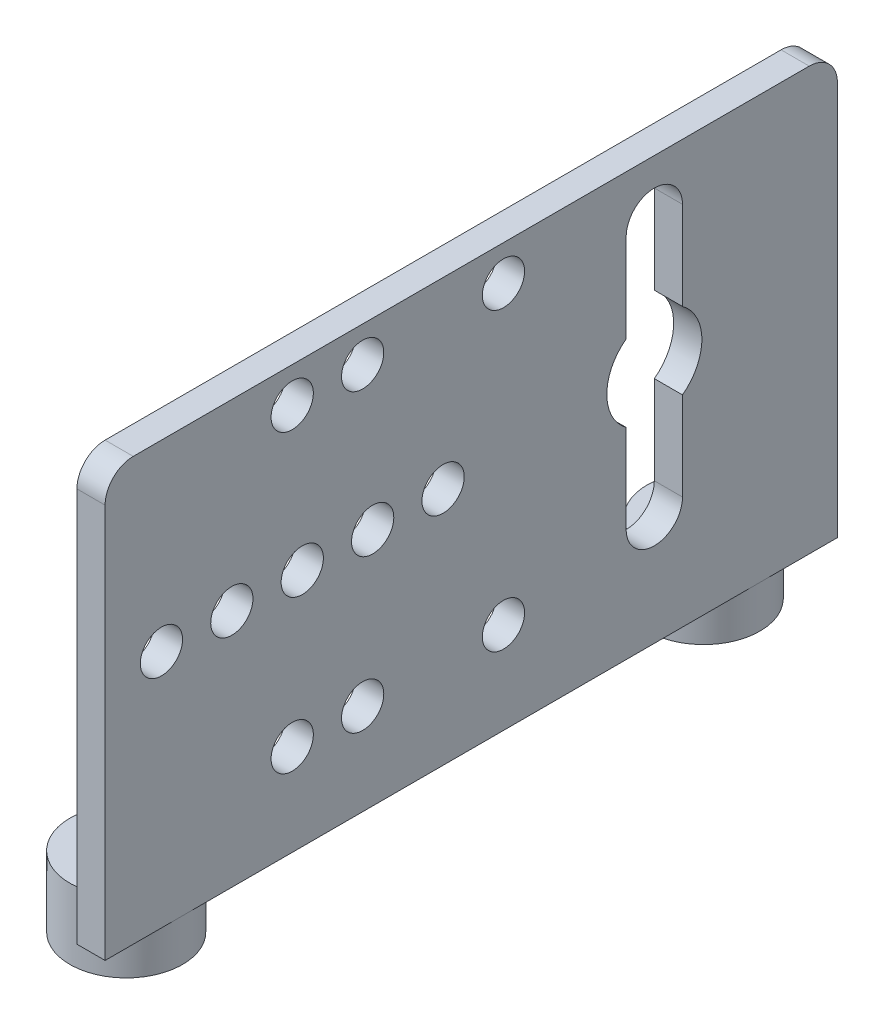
ISO-10303-21;
HEADER;
FILE_DESCRIPTION(('STEP AP214'),'2;1');
FILE_NAME('part.step','',(''),(''),'','','');
FILE_SCHEMA(('AUTOMOTIVE_DESIGN { 1 0 10303 214 1 1 1 1 }'));
ENDSEC;
DATA;
#1=APPLICATION_CONTEXT('core data for automotive mechanical design processes');
#2=APPLICATION_PROTOCOL_DEFINITION('international standard','automotive_design',2000,#1);
#3=PRODUCT_CONTEXT('',#1,'mechanical');
#4=PRODUCT('Part','Part','',(#3));
#5=PRODUCT_RELATED_PRODUCT_CATEGORY('part','',(#4));
#6=PRODUCT_DEFINITION_FORMATION('','',#4);
#7=PRODUCT_DEFINITION_CONTEXT('part definition',#1,'design');
#8=PRODUCT_DEFINITION('design','',#6,#7);
#9=PRODUCT_DEFINITION_SHAPE('','',#8);
#10=(LENGTH_UNIT() NAMED_UNIT(*) SI_UNIT(.MILLI.,.METRE.));
#11=(NAMED_UNIT(*) PLANE_ANGLE_UNIT() SI_UNIT($,.RADIAN.));
#12=(NAMED_UNIT(*) SI_UNIT($,.STERADIAN.) SOLID_ANGLE_UNIT());
#13=UNCERTAINTY_MEASURE_WITH_UNIT(LENGTH_MEASURE(1.E-05),#10,'distance_accuracy_value','');
#14=(GEOMETRIC_REPRESENTATION_CONTEXT(3) GLOBAL_UNCERTAINTY_ASSIGNED_CONTEXT((#13)) GLOBAL_UNIT_ASSIGNED_CONTEXT((#10,
#11,#12)) REPRESENTATION_CONTEXT('',''));
#15=CARTESIAN_POINT('',(0.,0.,0.));
#16=DIRECTION('',(0.,0.,1.));
#17=DIRECTION('',(1.,0.,0.));
#18=AXIS2_PLACEMENT_3D('',#15,#16,#17);
#19=CARTESIAN_POINT('',(0.,0.,52.));
#20=DIRECTION('',(0.,1.,0.));
#21=DIRECTION('',(0.,0.,1.));
#22=AXIS2_PLACEMENT_3D('',#19,#20,#21);
#23=PLANE('',#22);
#24=DIRECTION('',(0.,0.,-1.));
#25=VECTOR('',#24,1.);
#26=CARTESIAN_POINT('',(0.,0.,52.));
#27=LINE('',#26,#25);
#28=CARTESIAN_POINT('',(0.,0.,43.0358983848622));
#29=VERTEX_POINT('',#28);
#30=CARTESIAN_POINT('',(0.,0.,8.96410161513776));
#31=VERTEX_POINT('',#30);
#32=EDGE_CURVE('E385',#29,#31,#27,.T.);
#33=ORIENTED_EDGE('',*,*,#32,.T.);
#34=CARTESIAN_POINT('',(-2.,0.,5.5));
#35=DIRECTION('',(0.,1.,0.));
#36=DIRECTION('',(0.,0.,1.));
#37=AXIS2_PLACEMENT_3D('',#34,#35,#36);
#38=CIRCLE('',#37,4.);
#39=CARTESIAN_POINT('',(2.,0.,5.5));
#40=VERTEX_POINT('',#39);
#41=EDGE_CURVE('E256',#31,#40,#38,.T.);
#42=ORIENTED_EDGE('',*,*,#41,.T.);
#43=DIRECTION('',(0.,0.,1.));
#44=VECTOR('',#43,1.);
#45=CARTESIAN_POINT('',(2.,0.,0.));
#46=LINE('',#45,#44);
#47=CARTESIAN_POINT('',(2.,0.,46.5));
#48=VERTEX_POINT('',#47);
#49=EDGE_CURVE('E292',#40,#48,#46,.T.);
#50=ORIENTED_EDGE('',*,*,#49,.T.);
#51=CARTESIAN_POINT('',(-2.,0.,46.5));
#52=DIRECTION('',(0.,1.,0.));
#53=DIRECTION('',(0.,0.,1.));
#54=AXIS2_PLACEMENT_3D('',#51,#52,#53);
#55=CIRCLE('',#54,4.);
#56=EDGE_CURVE('E281',#29,#48,#55,.F.);
#57=ORIENTED_EDGE('',*,*,#56,.F.);
#58=EDGE_LOOP('',(#33,#42,#50,#57));
#59=FACE_BOUND('',#58,.T.);
#60=ADVANCED_FACE('F33',(#59),#23,.F.);
#61=CARTESIAN_POINT('',(0.,30.,52.));
#62=DIRECTION('',(1.,0.,0.));
#63=DIRECTION('',(0.,1.,0.));
#64=AXIS2_PLACEMENT_3D('',#61,#62,#63);
#65=PLANE('',#64);
#66=DIRECTION('',(0.,-1.,0.));
#67=VECTOR('',#66,1.);
#68=CARTESIAN_POINT('',(0.,30.,15.));
#69=LINE('',#68,#67);
#70=CARTESIAN_POINT('',(0.,14.2814296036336,15.));
#71=VERTEX_POINT('',#70);
#72=CARTESIAN_POINT('',(0.,8.00000000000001,15.));
#73=VERTEX_POINT('',#72);
#74=EDGE_CURVE('E201',#71,#73,#69,.T.);
#75=ORIENTED_EDGE('',*,*,#74,.T.);
#76=CARTESIAN_POINT('',(0.,8.,13.));
#77=DIRECTION('',(1.,0.,0.));
#78=DIRECTION('',(0.,1.,0.));
#79=AXIS2_PLACEMENT_3D('',#76,#77,#78);
#80=CIRCLE('',#79,2.);
#81=CARTESIAN_POINT('',(0.,8.,11.));
#82=VERTEX_POINT('',#81);
#83=EDGE_CURVE('E170',#73,#82,#80,.T.);
#84=ORIENTED_EDGE('',*,*,#83,.T.);
#85=DIRECTION('',(0.,1.,0.));
#86=VECTOR('',#85,1.);
#87=CARTESIAN_POINT('',(0.,30.,11.));
#88=LINE('',#87,#86);
#89=CARTESIAN_POINT('',(0.,14.2814296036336,11.));
#90=VERTEX_POINT('',#89);
#91=EDGE_CURVE('E234',#82,#90,#88,.T.);
#92=ORIENTED_EDGE('',*,*,#91,.T.);
#93=CARTESIAN_POINT('',(0.,17.,13.));
#94=DIRECTION('',(1.,0.,0.));
#95=DIRECTION('',(0.,1.,0.));
#96=AXIS2_PLACEMENT_3D('',#93,#94,#95);
#97=CIRCLE('',#96,3.375);
#98=CARTESIAN_POINT('',(0.,19.7185703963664,11.));
#99=VERTEX_POINT('',#98);
#100=EDGE_CURVE('E231',#90,#99,#97,.T.);
#101=ORIENTED_EDGE('',*,*,#100,.T.);
#102=DIRECTION('',(0.,1.,0.));
#103=VECTOR('',#102,1.);
#104=CARTESIAN_POINT('',(0.,30.,11.));
#105=LINE('',#104,#103);
#106=CARTESIAN_POINT('',(0.,26.,11.));
#107=VERTEX_POINT('',#106);
#108=EDGE_CURVE('E228',#99,#107,#105,.T.);
#109=ORIENTED_EDGE('',*,*,#108,.T.);
#110=CARTESIAN_POINT('',(0.,26.,13.));
#111=DIRECTION('',(1.,0.,0.));
#112=DIRECTION('',(0.,1.,0.));
#113=AXIS2_PLACEMENT_3D('',#110,#111,#112);
#114=CIRCLE('',#113,2.);
#115=CARTESIAN_POINT('',(0.,26.,15.));
#116=VERTEX_POINT('',#115);
#117=EDGE_CURVE('E225',#107,#116,#114,.T.);
#118=ORIENTED_EDGE('',*,*,#117,.T.);
#119=DIRECTION('',(0.,-1.,0.));
#120=VECTOR('',#119,1.);
#121=CARTESIAN_POINT('',(0.,30.,15.));
#122=LINE('',#121,#120);
#123=CARTESIAN_POINT('',(0.,19.7185703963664,15.));
#124=VERTEX_POINT('',#123);
#125=EDGE_CURVE('E222',#116,#124,#122,.T.);
#126=ORIENTED_EDGE('',*,*,#125,.T.);
#127=CARTESIAN_POINT('',(0.,17.,13.));
#128=DIRECTION('',(1.,0.,0.));
#129=DIRECTION('',(0.,1.,0.));
#130=AXIS2_PLACEMENT_3D('',#127,#128,#129);
#131=CIRCLE('',#130,3.375);
#132=EDGE_CURVE('E219',#124,#71,#131,.T.);
#133=ORIENTED_EDGE('',*,*,#132,.T.);
#134=EDGE_LOOP('',(#75,#84,#92,#101,#109,#118,#126,#133));
#135=FACE_BOUND('',#134,.T.);
#136=CARTESIAN_POINT('',(0.,0.,2.03589838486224));
#137=VERTEX_POINT('',#136);
#138=CARTESIAN_POINT('',(0.,0.,0.));
#139=VERTEX_POINT('',#138);
#140=EDGE_CURVE('E381',#137,#139,#27,.T.);
#141=ORIENTED_EDGE('',*,*,#140,.F.);
#142=DIRECTION('',(0.,1.,0.));
#143=VECTOR('',#142,1.);
#144=CARTESIAN_POINT('',(0.,-3.,2.03589838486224));
#145=LINE('',#144,#143);
#146=CARTESIAN_POINT('',(0.,2.,2.03589838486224));
#147=VERTEX_POINT('',#146);
#148=EDGE_CURVE('E255',#137,#147,#145,.T.);
#149=ORIENTED_EDGE('',*,*,#148,.T.);
#150=DIRECTION('',(0.,0.,-1.));
#151=VECTOR('',#150,1.);
#152=CARTESIAN_POINT('',(0.,2.,52.));
#153=LINE('',#152,#151);
#154=CARTESIAN_POINT('',(0.,2.,8.96410161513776));
#155=VERTEX_POINT('',#154);
#156=EDGE_CURVE('E248',#155,#147,#153,.T.);
#157=ORIENTED_EDGE('',*,*,#156,.F.);
#158=DIRECTION('',(0.,1.,0.));
#159=VECTOR('',#158,1.);
#160=CARTESIAN_POINT('',(0.,-3.,8.96410161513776));
#161=LINE('',#160,#159);
#162=EDGE_CURVE('E259',#155,#31,#161,.F.);
#163=ORIENTED_EDGE('',*,*,#162,.T.);
#164=ORIENTED_EDGE('',*,*,#32,.F.);
#165=DIRECTION('',(0.,1.,0.));
#166=VECTOR('',#165,1.);
#167=CARTESIAN_POINT('',(0.,-3.,43.0358983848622));
#168=LINE('',#167,#166);
#169=CARTESIAN_POINT('',(0.,2.,43.0358983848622));
#170=VERTEX_POINT('',#169);
#171=EDGE_CURVE('E284',#170,#29,#168,.F.);
#172=ORIENTED_EDGE('',*,*,#171,.F.);
#173=DIRECTION('',(0.,0.,-1.));
#174=VECTOR('',#173,1.);
#175=CARTESIAN_POINT('',(0.,2.,52.));
#176=LINE('',#175,#174);
#177=CARTESIAN_POINT('',(0.,2.,49.9641016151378));
#178=VERTEX_POINT('',#177);
#179=EDGE_CURVE('E272',#178,#170,#176,.T.);
#180=ORIENTED_EDGE('',*,*,#179,.F.);
#181=DIRECTION('',(0.,1.,0.));
#182=VECTOR('',#181,1.);
#183=CARTESIAN_POINT('',(0.,-3.,49.9641016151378));
#184=LINE('',#183,#182);
#185=CARTESIAN_POINT('',(0.,0.,49.9641016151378));
#186=VERTEX_POINT('',#185);
#187=EDGE_CURVE('E280',#186,#178,#184,.T.);
#188=ORIENTED_EDGE('',*,*,#187,.F.);
#189=CARTESIAN_POINT('',(0.,0.,52.));
#190=VERTEX_POINT('',#189);
#191=EDGE_CURVE('E382',#190,#186,#27,.T.);
#192=ORIENTED_EDGE('',*,*,#191,.F.);
#193=DIRECTION('',(0.,-1.,0.));
#194=VECTOR('',#193,1.);
#195=CARTESIAN_POINT('',(0.,30.,52.));
#196=LINE('',#195,#194);
#197=CARTESIAN_POINT('',(0.,28.,52.));
#198=VERTEX_POINT('',#197);
#199=EDGE_CURVE('E359',#198,#190,#196,.T.);
#200=ORIENTED_EDGE('',*,*,#199,.F.);
#201=CARTESIAN_POINT('',(0.,28.,50.));
#202=DIRECTION('',(1.,0.,0.));
#203=DIRECTION('',(0.,1.,0.));
#204=AXIS2_PLACEMENT_3D('',#201,#202,#203);
#205=CIRCLE('',#204,2.);
#206=CARTESIAN_POINT('',(0.,30.,50.));
#207=VERTEX_POINT('',#206);
#208=EDGE_CURVE('E390',#198,#207,#205,.F.);
#209=ORIENTED_EDGE('',*,*,#208,.T.);
#210=DIRECTION('',(0.,0.,-1.));
#211=VECTOR('',#210,1.);
#212=CARTESIAN_POINT('',(0.,30.,52.));
#213=LINE('',#212,#211);
#214=CARTESIAN_POINT('',(0.,30.,2.00000000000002));
#215=VERTEX_POINT('',#214);
#216=EDGE_CURVE('E368',#207,#215,#213,.T.);
#217=ORIENTED_EDGE('',*,*,#216,.T.);
#218=CARTESIAN_POINT('',(0.,28.,2.));
#219=DIRECTION('',(1.,0.,0.));
#220=DIRECTION('',(0.,1.,0.));
#221=AXIS2_PLACEMENT_3D('',#218,#219,#220);
#222=CIRCLE('',#221,2.);
#223=CARTESIAN_POINT('',(0.,28.,0.));
#224=VERTEX_POINT('',#223);
#225=EDGE_CURVE('E392',#215,#224,#222,.F.);
#226=ORIENTED_EDGE('',*,*,#225,.T.);
#227=DIRECTION('',(0.,-1.,0.));
#228=VECTOR('',#227,1.);
#229=CARTESIAN_POINT('',(0.,30.,0.));
#230=LINE('',#229,#228);
#231=EDGE_CURVE('E358',#224,#139,#230,.T.);
#232=ORIENTED_EDGE('',*,*,#231,.T.);
#233=EDGE_LOOP('',(#141,#149,#157,#163,#164,#172,#180,#188,#192,#200,#209,#217,#226,#232));
#234=FACE_BOUND('',#233,.T.);
#235=CARTESIAN_POINT('',(0.,17.,43.));
#236=DIRECTION('',(1.,0.,0.));
#237=DIRECTION('',(0.,1.,0.));
#238=AXIS2_PLACEMENT_3D('',#235,#236,#237);
#239=CIRCLE('',#238,1.5);
#240=CARTESIAN_POINT('',(0.,18.5,43.));
#241=VERTEX_POINT('',#240);
#242=EDGE_CURVE('E355',#241,#241,#239,.F.);
#243=ORIENTED_EDGE('',*,*,#242,.F.);
#244=EDGE_LOOP('',(#243));
#245=FACE_BOUND('',#244,.T.);
#246=CARTESIAN_POINT('',(0.,17.,38.));
#247=DIRECTION('',(1.,0.,0.));
#248=DIRECTION('',(0.,1.,0.));
#249=AXIS2_PLACEMENT_3D('',#246,#247,#248);
#250=CIRCLE('',#249,1.5);
#251=CARTESIAN_POINT('',(0.,18.5,38.));
#252=VERTEX_POINT('',#251);
#253=EDGE_CURVE('E337',#252,#252,#250,.F.);
#254=ORIENTED_EDGE('',*,*,#253,.F.);
#255=EDGE_LOOP('',(#254));
#256=FACE_BOUND('',#255,.T.);
#257=CARTESIAN_POINT('',(0.,17.,28.));
#258=DIRECTION('',(1.,0.,0.));
#259=DIRECTION('',(0.,1.,0.));
#260=AXIS2_PLACEMENT_3D('',#257,#258,#259);
#261=CIRCLE('',#260,1.5);
#262=CARTESIAN_POINT('',(0.,18.5,28.));
#263=VERTEX_POINT('',#262);
#264=EDGE_CURVE('E326',#263,#263,#261,.F.);
#265=ORIENTED_EDGE('',*,*,#264,.F.);
#266=EDGE_LOOP('',(#265));
#267=FACE_BOUND('',#266,.T.);
#268=CARTESIAN_POINT('',(0.,27.5,38.7121426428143));
#269=DIRECTION('',(1.,0.,0.));
#270=DIRECTION('',(0.,1.,0.));
#271=AXIS2_PLACEMENT_3D('',#268,#269,#270);
#272=CIRCLE('',#271,1.5);
#273=CARTESIAN_POINT('',(0.,29.,38.7121426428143));
#274=VERTEX_POINT('',#273);
#275=EDGE_CURVE('E327',#274,#274,#272,.F.);
#276=ORIENTED_EDGE('',*,*,#275,.F.);
#277=EDGE_LOOP('',(#276));
#278=FACE_BOUND('',#277,.T.);
#279=CARTESIAN_POINT('',(0.,17.,48.));
#280=DIRECTION('',(1.,0.,0.));
#281=DIRECTION('',(0.,1.,0.));
#282=AXIS2_PLACEMENT_3D('',#279,#280,#281);
#283=CIRCLE('',#282,1.5);
#284=CARTESIAN_POINT('',(0.,18.5,48.));
#285=VERTEX_POINT('',#284);
#286=EDGE_CURVE('E345',#285,#285,#283,.F.);
#287=ORIENTED_EDGE('',*,*,#286,.F.);
#288=EDGE_LOOP('',(#287));
#289=FACE_BOUND('',#288,.T.);
#290=CARTESIAN_POINT('',(0.,17.,33.));
#291=DIRECTION('',(1.,0.,0.));
#292=DIRECTION('',(0.,1.,0.));
#293=AXIS2_PLACEMENT_3D('',#290,#291,#292);
#294=CIRCLE('',#293,1.5);
#295=CARTESIAN_POINT('',(0.,18.5,33.));
#296=VERTEX_POINT('',#295);
#297=EDGE_CURVE('E344',#296,#296,#294,.F.);
#298=ORIENTED_EDGE('',*,*,#297,.F.);
#299=EDGE_LOOP('',(#298));
#300=FACE_BOUND('',#299,.T.);
#301=CARTESIAN_POINT('',(0.,6.50000000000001,23.7121426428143));
#302=DIRECTION('',(1.,0.,0.));
#303=DIRECTION('',(0.,1.,0.));
#304=AXIS2_PLACEMENT_3D('',#301,#302,#303);
#305=CIRCLE('',#304,1.5);
#306=CARTESIAN_POINT('',(0.,8.00000000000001,23.7121426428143));
#307=VERTEX_POINT('',#306);
#308=EDGE_CURVE('E304',#307,#307,#305,.F.);
#309=ORIENTED_EDGE('',*,*,#308,.F.);
#310=EDGE_LOOP('',(#309));
#311=FACE_BOUND('',#310,.T.);
#312=CARTESIAN_POINT('',(0.,27.5,23.7121426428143));
#313=DIRECTION('',(1.,0.,0.));
#314=DIRECTION('',(0.,1.,0.));
#315=AXIS2_PLACEMENT_3D('',#312,#313,#314);
#316=CIRCLE('',#315,1.5);
#317=CARTESIAN_POINT('',(0.,29.,23.7121426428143));
#318=VERTEX_POINT('',#317);
#319=EDGE_CURVE('E297',#318,#318,#316,.F.);
#320=ORIENTED_EDGE('',*,*,#319,.F.);
#321=EDGE_LOOP('',(#320));
#322=FACE_BOUND('',#321,.T.);
#323=CARTESIAN_POINT('',(0.,6.50000000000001,38.7121426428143));
#324=DIRECTION('',(1.,0.,0.));
#325=DIRECTION('',(0.,1.,0.));
#326=AXIS2_PLACEMENT_3D('',#323,#324,#325);
#327=CIRCLE('',#326,1.5);
#328=CARTESIAN_POINT('',(0.,8.00000000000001,38.7121426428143));
#329=VERTEX_POINT('',#328);
#330=EDGE_CURVE('E296',#329,#329,#327,.F.);
#331=ORIENTED_EDGE('',*,*,#330,.F.);
#332=EDGE_LOOP('',(#331));
#333=FACE_BOUND('',#332,.T.);
#334=CARTESIAN_POINT('',(0.,6.50000000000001,33.7121426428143));
#335=DIRECTION('',(1.,0.,0.));
#336=DIRECTION('',(0.,1.,0.));
#337=AXIS2_PLACEMENT_3D('',#334,#335,#336);
#338=CIRCLE('',#337,1.5);
#339=CARTESIAN_POINT('',(0.,8.00000000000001,33.7121426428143));
#340=VERTEX_POINT('',#339);
#341=EDGE_CURVE('E315',#340,#340,#338,.F.);
#342=ORIENTED_EDGE('',*,*,#341,.F.);
#343=EDGE_LOOP('',(#342));
#344=FACE_BOUND('',#343,.T.);
#345=CARTESIAN_POINT('',(0.,27.5,33.7121426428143));
#346=DIRECTION('',(1.,0.,0.));
#347=DIRECTION('',(0.,1.,0.));
#348=AXIS2_PLACEMENT_3D('',#345,#346,#347);
#349=CIRCLE('',#348,1.5);
#350=CARTESIAN_POINT('',(0.,29.,33.7121426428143));
#351=VERTEX_POINT('',#350);
#352=EDGE_CURVE('E314',#351,#351,#349,.F.);
#353=ORIENTED_EDGE('',*,*,#352,.F.);
#354=EDGE_LOOP('',(#353));
#355=FACE_BOUND('',#354,.T.);
#356=ADVANCED_FACE('F414',(#135,#234,#245,#256,#267,#278,#289,#300,#311,#322,#333,#344,#355),
#65,.F.);
#357=CARTESIAN_POINT('',(2.,0.,0.));
#358=VERTEX_POINT('',#357);
#359=EDGE_CURVE('E288',#358,#40,#46,.T.);
#360=ORIENTED_EDGE('',*,*,#359,.T.);
#361=EDGE_CURVE('E252',#40,#137,#38,.T.);
#362=ORIENTED_EDGE('',*,*,#361,.T.);
#363=ORIENTED_EDGE('',*,*,#140,.T.);
#364=DIRECTION('',(1.,0.,0.));
#365=VECTOR('',#364,1.);
#366=CARTESIAN_POINT('',(0.,0.,0.));
#367=LINE('',#366,#365);
#368=EDGE_CURVE('E371',#139,#358,#367,.T.);
#369=ORIENTED_EDGE('',*,*,#368,.T.);
#370=EDGE_LOOP('',(#360,#362,#363,#369));
#371=FACE_BOUND('',#370,.T.);
#372=ADVANCED_FACE('F420',(#371),#23,.F.);
#373=EDGE_CURVE('E277',#48,#186,#55,.F.);
#374=ORIENTED_EDGE('',*,*,#373,.F.);
#375=CARTESIAN_POINT('',(2.,0.,52.));
#376=VERTEX_POINT('',#375);
#377=EDGE_CURVE('E287',#48,#376,#46,.T.);
#378=ORIENTED_EDGE('',*,*,#377,.T.);
#379=DIRECTION('',(1.,0.,0.));
#380=VECTOR('',#379,1.);
#381=CARTESIAN_POINT('',(0.,0.,52.));
#382=LINE('',#381,#380);
#383=EDGE_CURVE('E361',#190,#376,#382,.T.);
#384=ORIENTED_EDGE('',*,*,#383,.F.);
#385=ORIENTED_EDGE('',*,*,#191,.T.);
#386=EDGE_LOOP('',(#374,#378,#384,#385));
#387=FACE_BOUND('',#386,.T.);
#388=ADVANCED_FACE('F438',(#387),#23,.F.);
#389=CARTESIAN_POINT('',(2.,3.,52.));
#390=DIRECTION('',(-1.,0.,0.));
#391=DIRECTION('',(0.,-1.,0.));
#392=AXIS2_PLACEMENT_3D('',#389,#390,#391);
#393=PLANE('',#392);
#394=DIRECTION('',(0.,-1.,0.));
#395=VECTOR('',#394,1.);
#396=CARTESIAN_POINT('',(2.00000000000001,8.,11.));
#397=LINE('',#396,#395);
#398=CARTESIAN_POINT('',(2.00000000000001,14.2814296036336,11.));
#399=VERTEX_POINT('',#398);
#400=CARTESIAN_POINT('',(2.00000000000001,8.,11.));
#401=VERTEX_POINT('',#400);
#402=EDGE_CURVE('E173',#399,#401,#397,.T.);
#403=ORIENTED_EDGE('',*,*,#402,.T.);
#404=CARTESIAN_POINT('',(2.00000000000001,8.,13.));
#405=DIRECTION('',(-1.,0.,0.));
#406=DIRECTION('',(0.,1.,0.));
#407=AXIS2_PLACEMENT_3D('',#404,#405,#406);
#408=CIRCLE('',#407,2.);
#409=CARTESIAN_POINT('',(2.00000000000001,8.,15.));
#410=VERTEX_POINT('',#409);
#411=EDGE_CURVE('E167',#401,#410,#408,.T.);
#412=ORIENTED_EDGE('',*,*,#411,.T.);
#413=DIRECTION('',(0.,1.,0.));
#414=VECTOR('',#413,1.);
#415=CARTESIAN_POINT('',(2.00000000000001,8.,15.));
#416=LINE('',#415,#414);
#417=CARTESIAN_POINT('',(2.,14.2814296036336,15.));
#418=VERTEX_POINT('',#417);
#419=EDGE_CURVE('E176',#410,#418,#416,.T.);
#420=ORIENTED_EDGE('',*,*,#419,.T.);
#421=CARTESIAN_POINT('',(2.00000000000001,17.,13.));
#422=DIRECTION('',(-1.,0.,0.));
#423=DIRECTION('',(0.,-1.,0.));
#424=AXIS2_PLACEMENT_3D('',#421,#422,#423);
#425=CIRCLE('',#424,3.375);
#426=CARTESIAN_POINT('',(2.00000000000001,19.7185703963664,15.));
#427=VERTEX_POINT('',#426);
#428=EDGE_CURVE('E56',#418,#427,#425,.T.);
#429=ORIENTED_EDGE('',*,*,#428,.T.);
#430=DIRECTION('',(0.,1.,0.));
#431=VECTOR('',#430,1.);
#432=CARTESIAN_POINT('',(2.00000000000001,26.,15.));
#433=LINE('',#432,#431);
#434=CARTESIAN_POINT('',(2.00000000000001,26.,15.));
#435=VERTEX_POINT('',#434);
#436=EDGE_CURVE('E187',#427,#435,#433,.T.);
#437=ORIENTED_EDGE('',*,*,#436,.T.);
#438=CARTESIAN_POINT('',(2.00000000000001,26.,13.));
#439=DIRECTION('',(-1.,0.,0.));
#440=DIRECTION('',(0.,-1.,0.));
#441=AXIS2_PLACEMENT_3D('',#438,#439,#440);
#442=CIRCLE('',#441,2.);
#443=CARTESIAN_POINT('',(2.00000000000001,26.,11.));
#444=VERTEX_POINT('',#443);
#445=EDGE_CURVE('E190',#435,#444,#442,.T.);
#446=ORIENTED_EDGE('',*,*,#445,.T.);
#447=DIRECTION('',(0.,-1.,0.));
#448=VECTOR('',#447,1.);
#449=CARTESIAN_POINT('',(2.00000000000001,26.,11.));
#450=LINE('',#449,#448);
#451=CARTESIAN_POINT('',(2.00000000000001,19.7185703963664,11.));
#452=VERTEX_POINT('',#451);
#453=EDGE_CURVE('E193',#444,#452,#450,.T.);
#454=ORIENTED_EDGE('',*,*,#453,.T.);
#455=CARTESIAN_POINT('',(2.00000000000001,17.,13.));
#456=DIRECTION('',(-1.,0.,0.));
#457=DIRECTION('',(0.,-1.,0.));
#458=AXIS2_PLACEMENT_3D('',#455,#456,#457);
#459=CIRCLE('',#458,3.375);
#460=EDGE_CURVE('E196',#452,#399,#459,.T.);
#461=ORIENTED_EDGE('',*,*,#460,.T.);
#462=EDGE_LOOP('',(#403,#412,#420,#429,#437,#446,#454,#461));
#463=FACE_BOUND('',#462,.T.);
#464=ORIENTED_EDGE('',*,*,#377,.F.);
#465=ORIENTED_EDGE('',*,*,#49,.F.);
#466=ORIENTED_EDGE('',*,*,#359,.F.);
#467=DIRECTION('',(0.,1.,0.));
#468=VECTOR('',#467,1.);
#469=CARTESIAN_POINT('',(2.,3.,0.));
#470=LINE('',#469,#468);
#471=CARTESIAN_POINT('',(2.,28.,0.));
#472=VERTEX_POINT('',#471);
#473=EDGE_CURVE('E362',#358,#472,#470,.T.);
#474=ORIENTED_EDGE('',*,*,#473,.T.);
#475=CARTESIAN_POINT('',(2.,28.,2.));
#476=DIRECTION('',(-1.,0.,0.));
#477=DIRECTION('',(0.,-1.,0.));
#478=AXIS2_PLACEMENT_3D('',#475,#476,#477);
#479=CIRCLE('',#478,2.);
#480=CARTESIAN_POINT('',(2.,30.,2.00000000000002));
#481=VERTEX_POINT('',#480);
#482=EDGE_CURVE('E41',#472,#481,#479,.F.);
#483=ORIENTED_EDGE('',*,*,#482,.T.);
#484=DIRECTION('',(0.,0.,-1.));
#485=VECTOR('',#484,1.);
#486=CARTESIAN_POINT('',(2.,30.,52.));
#487=LINE('',#486,#485);
#488=CARTESIAN_POINT('',(2.,30.,50.));
#489=VERTEX_POINT('',#488);
#490=EDGE_CURVE('E378',#489,#481,#487,.T.);
#491=ORIENTED_EDGE('',*,*,#490,.F.);
#492=CARTESIAN_POINT('',(2.,28.,50.));
#493=DIRECTION('',(-1.,0.,0.));
#494=DIRECTION('',(0.,-1.,0.));
#495=AXIS2_PLACEMENT_3D('',#492,#493,#494);
#496=CIRCLE('',#495,2.);
#497=CARTESIAN_POINT('',(2.,28.,52.));
#498=VERTEX_POINT('',#497);
#499=EDGE_CURVE('E396',#489,#498,#496,.F.);
#500=ORIENTED_EDGE('',*,*,#499,.T.);
#501=DIRECTION('',(0.,1.,0.));
#502=VECTOR('',#501,1.);
#503=CARTESIAN_POINT('',(2.,3.,52.));
#504=LINE('',#503,#502);
#505=EDGE_CURVE('E365',#376,#498,#504,.T.);
#506=ORIENTED_EDGE('',*,*,#505,.F.);
#507=EDGE_LOOP('',(#464,#465,#466,#474,#483,#491,#500,#506));
#508=FACE_BOUND('',#507,.T.);
#509=CARTESIAN_POINT('',(2.,27.5,33.7121426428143));
#510=DIRECTION('',(1.,0.,0.));
#511=DIRECTION('',(0.,1.,0.));
#512=AXIS2_PLACEMENT_3D('',#509,#510,#511);
#513=CIRCLE('',#512,1.5);
#514=CARTESIAN_POINT('',(2.,29.,33.7121426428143));
#515=VERTEX_POINT('',#514);
#516=EDGE_CURVE('E311',#515,#515,#513,.T.);
#517=ORIENTED_EDGE('',*,*,#516,.F.);
#518=EDGE_LOOP('',(#517));
#519=FACE_BOUND('',#518,.T.);
#520=CARTESIAN_POINT('',(2.,6.50000000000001,33.7121426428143));
#521=DIRECTION('',(1.,0.,0.));
#522=DIRECTION('',(0.,-1.,0.));
#523=AXIS2_PLACEMENT_3D('',#520,#521,#522);
#524=CIRCLE('',#523,1.5);
#525=CARTESIAN_POINT('',(2.,5.00000000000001,33.7121426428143));
#526=VERTEX_POINT('',#525);
#527=EDGE_CURVE('E300',#526,#526,#524,.T.);
#528=ORIENTED_EDGE('',*,*,#527,.F.);
#529=EDGE_LOOP('',(#528));
#530=FACE_BOUND('',#529,.T.);
#531=CARTESIAN_POINT('',(2.,6.50000000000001,38.7121426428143));
#532=DIRECTION('',(1.,0.,0.));
#533=DIRECTION('',(0.,-1.,0.));
#534=AXIS2_PLACEMENT_3D('',#531,#532,#533);
#535=CIRCLE('',#534,1.5);
#536=CARTESIAN_POINT('',(2.,5.,38.7121426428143));
#537=VERTEX_POINT('',#536);
#538=EDGE_CURVE('E293',#537,#537,#535,.T.);
#539=ORIENTED_EDGE('',*,*,#538,.F.);
#540=EDGE_LOOP('',(#539));
#541=FACE_BOUND('',#540,.T.);
#542=CARTESIAN_POINT('',(2.,27.5,23.7121426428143));
#543=DIRECTION('',(1.,0.,0.));
#544=DIRECTION('',(0.,-1.,0.));
#545=AXIS2_PLACEMENT_3D('',#542,#543,#544);
#546=CIRCLE('',#545,1.5);
#547=CARTESIAN_POINT('',(2.,26.,23.7121426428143));
#548=VERTEX_POINT('',#547);
#549=EDGE_CURVE('E301',#548,#548,#546,.T.);
#550=ORIENTED_EDGE('',*,*,#549,.F.);
#551=EDGE_LOOP('',(#550));
#552=FACE_BOUND('',#551,.T.);
#553=CARTESIAN_POINT('',(2.,6.50000000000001,23.7121426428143));
#554=DIRECTION('',(1.,0.,0.));
#555=DIRECTION('',(0.,1.,0.));
#556=AXIS2_PLACEMENT_3D('',#553,#554,#555);
#557=CIRCLE('',#556,1.5);
#558=CARTESIAN_POINT('',(2.,8.00000000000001,23.7121426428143));
#559=VERTEX_POINT('',#558);
#560=EDGE_CURVE('E291',#559,#559,#557,.T.);
#561=ORIENTED_EDGE('',*,*,#560,.F.);
#562=EDGE_LOOP('',(#561));
#563=FACE_BOUND('',#562,.T.);
#564=CARTESIAN_POINT('',(2.,17.,33.));
#565=DIRECTION('',(1.,0.,0.));
#566=DIRECTION('',(0.,1.,0.));
#567=AXIS2_PLACEMENT_3D('',#564,#565,#566);
#568=CIRCLE('',#567,1.5);
#569=CARTESIAN_POINT('',(2.,18.5,33.));
#570=VERTEX_POINT('',#569);
#571=EDGE_CURVE('E341',#570,#570,#568,.T.);
#572=ORIENTED_EDGE('',*,*,#571,.F.);
#573=EDGE_LOOP('',(#572));
#574=FACE_BOUND('',#573,.T.);
#575=CARTESIAN_POINT('',(2.,17.,48.));
#576=DIRECTION('',(1.,0.,0.));
#577=DIRECTION('',(0.,1.,0.));
#578=AXIS2_PLACEMENT_3D('',#575,#576,#577);
#579=CIRCLE('',#578,1.5);
#580=CARTESIAN_POINT('',(2.,18.5,48.));
#581=VERTEX_POINT('',#580);
#582=EDGE_CURVE('E340',#581,#581,#579,.T.);
#583=ORIENTED_EDGE('',*,*,#582,.F.);
#584=EDGE_LOOP('',(#583));
#585=FACE_BOUND('',#584,.T.);
#586=CARTESIAN_POINT('',(2.,27.5,38.7121426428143));
#587=DIRECTION('',(1.,0.,0.));
#588=DIRECTION('',(0.,1.,0.));
#589=AXIS2_PLACEMENT_3D('',#586,#587,#588);
#590=CIRCLE('',#589,1.5);
#591=CARTESIAN_POINT('',(2.,29.,38.7121426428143));
#592=VERTEX_POINT('',#591);
#593=EDGE_CURVE('E318',#592,#592,#590,.T.);
#594=ORIENTED_EDGE('',*,*,#593,.F.);
#595=EDGE_LOOP('',(#594));
#596=FACE_BOUND('',#595,.T.);
#597=CARTESIAN_POINT('',(2.,17.,28.));
#598=DIRECTION('',(1.,0.,0.));
#599=DIRECTION('',(0.,1.,0.));
#600=AXIS2_PLACEMENT_3D('',#597,#598,#599);
#601=CIRCLE('',#600,1.5);
#602=CARTESIAN_POINT('',(2.,18.5,28.));
#603=VERTEX_POINT('',#602);
#604=EDGE_CURVE('E323',#603,#603,#601,.T.);
#605=ORIENTED_EDGE('',*,*,#604,.F.);
#606=EDGE_LOOP('',(#605));
#607=FACE_BOUND('',#606,.T.);
#608=CARTESIAN_POINT('',(2.,17.,38.));
#609=DIRECTION('',(1.,0.,0.));
#610=DIRECTION('',(0.,1.,0.));
#611=AXIS2_PLACEMENT_3D('',#608,#609,#610);
#612=CIRCLE('',#611,1.5);
#613=CARTESIAN_POINT('',(2.,18.5,38.));
#614=VERTEX_POINT('',#613);
#615=EDGE_CURVE('E330',#614,#614,#612,.T.);
#616=ORIENTED_EDGE('',*,*,#615,.F.);
#617=EDGE_LOOP('',(#616));
#618=FACE_BOUND('',#617,.T.);
#619=CARTESIAN_POINT('',(2.,17.,43.));
#620=DIRECTION('',(1.,0.,0.));
#621=DIRECTION('',(0.,1.,0.));
#622=AXIS2_PLACEMENT_3D('',#619,#620,#621);
#623=CIRCLE('',#622,1.5);
#624=CARTESIAN_POINT('',(2.,18.5,43.));
#625=VERTEX_POINT('',#624);
#626=EDGE_CURVE('E348',#625,#625,#623,.T.);
#627=ORIENTED_EDGE('',*,*,#626,.F.);
#628=EDGE_LOOP('',(#627));
#629=FACE_BOUND('',#628,.T.);
#630=ADVANCED_FACE('F180',(#463,#508,#519,#530,#541,#552,#563,#574,#585,#596,#607,#618,#629),
#393,.F.);
#631=CARTESIAN_POINT('',(2.,30.,52.));
#632=DIRECTION('',(0.,-1.,0.));
#633=DIRECTION('',(0.,0.,-1.));
#634=AXIS2_PLACEMENT_3D('',#631,#632,#633);
#635=PLANE('',#634);
#636=ORIENTED_EDGE('',*,*,#490,.T.);
#637=DIRECTION('',(-1.,0.,0.));
#638=VECTOR('',#637,1.);
#639=CARTESIAN_POINT('',(2.,30.,2.));
#640=LINE('',#639,#638);
#641=EDGE_CURVE('E387',#481,#215,#640,.T.);
#642=ORIENTED_EDGE('',*,*,#641,.T.);
#643=ORIENTED_EDGE('',*,*,#216,.F.);
#644=DIRECTION('',(-1.,0.,0.));
#645=VECTOR('',#644,1.);
#646=CARTESIAN_POINT('',(2.,30.,50.));
#647=LINE('',#646,#645);
#648=EDGE_CURVE('E384',#207,#489,#647,.F.);
#649=ORIENTED_EDGE('',*,*,#648,.T.);
#650=EDGE_LOOP('',(#636,#642,#643,#649));
#651=FACE_BOUND('',#650,.T.);
#652=ADVANCED_FACE('F407',(#651),#635,.F.);
#653=CARTESIAN_POINT('',(0.,0.,52.));
#654=DIRECTION('',(0.,0.,1.));
#655=DIRECTION('',(1.,0.,0.));
#656=AXIS2_PLACEMENT_3D('',#653,#654,#655);
#657=PLANE('',#656);
#658=ORIENTED_EDGE('',*,*,#383,.T.);
#659=ORIENTED_EDGE('',*,*,#505,.T.);
#660=DIRECTION('',(-1.,0.,0.));
#661=VECTOR('',#660,1.);
#662=CARTESIAN_POINT('',(0.,28.,52.));
#663=LINE('',#662,#661);
#664=EDGE_CURVE('E11',#498,#198,#663,.T.);
#665=ORIENTED_EDGE('',*,*,#664,.T.);
#666=ORIENTED_EDGE('',*,*,#199,.T.);
#667=EDGE_LOOP('',(#658,#659,#665,#666));
#668=FACE_BOUND('',#667,.T.);
#669=ADVANCED_FACE('F443',(#668),#657,.T.);
#670=CARTESIAN_POINT('',(0.,0.,0.));
#671=DIRECTION('',(0.,0.,1.));
#672=DIRECTION('',(1.,0.,0.));
#673=AXIS2_PLACEMENT_3D('',#670,#671,#672);
#674=PLANE('',#673);
#675=ORIENTED_EDGE('',*,*,#473,.F.);
#676=ORIENTED_EDGE('',*,*,#368,.F.);
#677=ORIENTED_EDGE('',*,*,#231,.F.);
#678=DIRECTION('',(-1.,0.,0.));
#679=VECTOR('',#678,1.);
#680=CARTESIAN_POINT('',(0.,28.,0.));
#681=LINE('',#680,#679);
#682=EDGE_CURVE('E394',#224,#472,#681,.F.);
#683=ORIENTED_EDGE('',*,*,#682,.T.);
#684=EDGE_LOOP('',(#675,#676,#677,#683));
#685=FACE_BOUND('',#684,.T.);
#686=ADVANCED_FACE('F418',(#685),#674,.F.);
#687=CARTESIAN_POINT('',(2.,28.,2.));
#688=DIRECTION('',(-1.,0.,0.));
#689=DIRECTION('',(0.,0.,1.));
#690=AXIS2_PLACEMENT_3D('',#687,#688,#689);
#691=CYLINDRICAL_SURFACE('',#690,2.);
#692=ORIENTED_EDGE('',*,*,#482,.F.);
#693=ORIENTED_EDGE('',*,*,#682,.F.);
#694=ORIENTED_EDGE('',*,*,#225,.F.);
#695=ORIENTED_EDGE('',*,*,#641,.F.);
#696=EDGE_LOOP('',(#692,#693,#694,#695));
#697=FACE_BOUND('',#696,.T.);
#698=ADVANCED_FACE('F410',(#697),#691,.T.);
#699=CARTESIAN_POINT('',(0.,28.,50.));
#700=DIRECTION('',(1.,0.,0.));
#701=DIRECTION('',(0.,0.,-1.));
#702=AXIS2_PLACEMENT_3D('',#699,#700,#701);
#703=CYLINDRICAL_SURFACE('',#702,2.);
#704=ORIENTED_EDGE('',*,*,#499,.F.);
#705=ORIENTED_EDGE('',*,*,#648,.F.);
#706=ORIENTED_EDGE('',*,*,#208,.F.);
#707=ORIENTED_EDGE('',*,*,#664,.F.);
#708=EDGE_LOOP('',(#704,#705,#706,#707));
#709=FACE_BOUND('',#708,.T.);
#710=ADVANCED_FACE('F35',(#709),#703,.T.);
#711=CARTESIAN_POINT('',(-4.24264068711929,17.,43.));
#712=DIRECTION('',(1.,0.,0.));
#713=DIRECTION('',(0.,1.,0.));
#714=AXIS2_PLACEMENT_3D('',#711,#712,#713);
#715=CYLINDRICAL_SURFACE('',#714,1.5);
#716=ORIENTED_EDGE('',*,*,#242,.T.);
#717=EDGE_LOOP('',(#716));
#718=FACE_BOUND('',#717,.T.);
#719=ORIENTED_EDGE('',*,*,#626,.T.);
#720=EDGE_LOOP('',(#719));
#721=FACE_BOUND('',#720,.T.);
#722=ADVANCED_FACE('F446',(#718,#721),#715,.F.);
#723=CARTESIAN_POINT('',(-4.24264068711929,17.,38.));
#724=DIRECTION('',(1.,0.,0.));
#725=DIRECTION('',(0.,1.,0.));
#726=AXIS2_PLACEMENT_3D('',#723,#724,#725);
#727=CYLINDRICAL_SURFACE('',#726,1.5);
#728=ORIENTED_EDGE('',*,*,#253,.T.);
#729=EDGE_LOOP('',(#728));
#730=FACE_BOUND('',#729,.T.);
#731=ORIENTED_EDGE('',*,*,#615,.T.);
#732=EDGE_LOOP('',(#731));
#733=FACE_BOUND('',#732,.T.);
#734=ADVANCED_FACE('F451',(#730,#733),#727,.F.);
#735=CARTESIAN_POINT('',(-4.24264068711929,17.,28.));
#736=DIRECTION('',(1.,0.,0.));
#737=DIRECTION('',(0.,1.,0.));
#738=AXIS2_PLACEMENT_3D('',#735,#736,#737);
#739=CYLINDRICAL_SURFACE('',#738,1.5);
#740=ORIENTED_EDGE('',*,*,#264,.T.);
#741=EDGE_LOOP('',(#740));
#742=FACE_BOUND('',#741,.T.);
#743=ORIENTED_EDGE('',*,*,#604,.T.);
#744=EDGE_LOOP('',(#743));
#745=FACE_BOUND('',#744,.T.);
#746=ADVANCED_FACE('F491',(#742,#745),#739,.F.);
#747=CARTESIAN_POINT('',(-4.24264068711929,27.5,38.7121426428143));
#748=DIRECTION('',(1.,0.,0.));
#749=DIRECTION('',(0.,1.,0.));
#750=AXIS2_PLACEMENT_3D('',#747,#748,#749);
#751=CYLINDRICAL_SURFACE('',#750,1.5);
#752=ORIENTED_EDGE('',*,*,#275,.T.);
#753=EDGE_LOOP('',(#752));
#754=FACE_BOUND('',#753,.T.);
#755=ORIENTED_EDGE('',*,*,#593,.T.);
#756=EDGE_LOOP('',(#755));
#757=FACE_BOUND('',#756,.T.);
#758=ADVANCED_FACE('F483',(#754,#757),#751,.F.);
#759=CARTESIAN_POINT('',(-4.24264068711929,17.,48.));
#760=DIRECTION('',(1.,0.,0.));
#761=DIRECTION('',(0.,1.,0.));
#762=AXIS2_PLACEMENT_3D('',#759,#760,#761);
#763=CYLINDRICAL_SURFACE('',#762,1.5);
#764=ORIENTED_EDGE('',*,*,#286,.T.);
#765=EDGE_LOOP('',(#764));
#766=FACE_BOUND('',#765,.T.);
#767=ORIENTED_EDGE('',*,*,#582,.T.);
#768=EDGE_LOOP('',(#767));
#769=FACE_BOUND('',#768,.T.);
#770=ADVANCED_FACE('F479',(#766,#769),#763,.F.);
#771=CARTESIAN_POINT('',(-4.24264068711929,17.,33.));
#772=DIRECTION('',(1.,0.,0.));
#773=DIRECTION('',(0.,1.,0.));
#774=AXIS2_PLACEMENT_3D('',#771,#772,#773);
#775=CYLINDRICAL_SURFACE('',#774,1.5);
#776=ORIENTED_EDGE('',*,*,#297,.T.);
#777=EDGE_LOOP('',(#776));
#778=FACE_BOUND('',#777,.T.);
#779=ORIENTED_EDGE('',*,*,#571,.T.);
#780=EDGE_LOOP('',(#779));
#781=FACE_BOUND('',#780,.T.);
#782=ADVANCED_FACE('F482',(#778,#781),#775,.F.);
#783=CARTESIAN_POINT('',(-4.24264068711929,6.50000000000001,23.7121426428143));
#784=DIRECTION('',(1.,0.,0.));
#785=DIRECTION('',(0.,1.,0.));
#786=AXIS2_PLACEMENT_3D('',#783,#784,#785);
#787=CYLINDRICAL_SURFACE('',#786,1.5);
#788=ORIENTED_EDGE('',*,*,#308,.T.);
#789=EDGE_LOOP('',(#788));
#790=FACE_BOUND('',#789,.T.);
#791=ORIENTED_EDGE('',*,*,#560,.T.);
#792=EDGE_LOOP('',(#791));
#793=FACE_BOUND('',#792,.T.);
#794=ADVANCED_FACE('F487',(#790,#793),#787,.F.);
#795=CARTESIAN_POINT('',(-4.24264068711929,27.5,23.7121426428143));
#796=DIRECTION('',(1.,0.,0.));
#797=DIRECTION('',(0.,1.,0.));
#798=AXIS2_PLACEMENT_3D('',#795,#796,#797);
#799=CYLINDRICAL_SURFACE('',#798,1.5);
#800=ORIENTED_EDGE('',*,*,#319,.T.);
#801=EDGE_LOOP('',(#800));
#802=FACE_BOUND('',#801,.T.);
#803=ORIENTED_EDGE('',*,*,#549,.T.);
#804=EDGE_LOOP('',(#803));
#805=FACE_BOUND('',#804,.T.);
#806=ADVANCED_FACE('F510',(#802,#805),#799,.F.);
#807=CARTESIAN_POINT('',(-4.24264068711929,6.50000000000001,38.7121426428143));
#808=DIRECTION('',(1.,0.,0.));
#809=DIRECTION('',(0.,1.,0.));
#810=AXIS2_PLACEMENT_3D('',#807,#808,#809);
#811=CYLINDRICAL_SURFACE('',#810,1.5);
#812=ORIENTED_EDGE('',*,*,#330,.T.);
#813=EDGE_LOOP('',(#812));
#814=FACE_BOUND('',#813,.T.);
#815=ORIENTED_EDGE('',*,*,#538,.T.);
#816=EDGE_LOOP('',(#815));
#817=FACE_BOUND('',#816,.T.);
#818=ADVANCED_FACE('F503',(#814,#817),#811,.F.);
#819=CARTESIAN_POINT('',(-4.24264068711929,6.50000000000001,33.7121426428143));
#820=DIRECTION('',(1.,0.,0.));
#821=DIRECTION('',(0.,1.,0.));
#822=AXIS2_PLACEMENT_3D('',#819,#820,#821);
#823=CYLINDRICAL_SURFACE('',#822,1.5);
#824=ORIENTED_EDGE('',*,*,#341,.T.);
#825=EDGE_LOOP('',(#824));
#826=FACE_BOUND('',#825,.T.);
#827=ORIENTED_EDGE('',*,*,#527,.T.);
#828=EDGE_LOOP('',(#827));
#829=FACE_BOUND('',#828,.T.);
#830=ADVANCED_FACE('F499',(#826,#829),#823,.F.);
#831=CARTESIAN_POINT('',(-4.24264068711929,27.5,33.7121426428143));
#832=DIRECTION('',(1.,0.,0.));
#833=DIRECTION('',(0.,1.,0.));
#834=AXIS2_PLACEMENT_3D('',#831,#832,#833);
#835=CYLINDRICAL_SURFACE('',#834,1.5);
#836=ORIENTED_EDGE('',*,*,#352,.T.);
#837=EDGE_LOOP('',(#836));
#838=FACE_BOUND('',#837,.T.);
#839=ORIENTED_EDGE('',*,*,#516,.T.);
#840=EDGE_LOOP('',(#839));
#841=FACE_BOUND('',#840,.T.);
#842=ADVANCED_FACE('F502',(#838,#841),#835,.F.);
#843=CARTESIAN_POINT('',(-2.,-3.,46.5));
#844=DIRECTION('',(0.,1.,0.));
#845=DIRECTION('',(0.,0.,1.));
#846=AXIS2_PLACEMENT_3D('',#843,#844,#845);
#847=CYLINDRICAL_SURFACE('',#846,4.);
#848=CARTESIAN_POINT('',(-2.,-3.,46.5));
#849=DIRECTION('',(0.,-1.,0.));
#850=DIRECTION('',(0.,0.,-1.));
#851=AXIS2_PLACEMENT_3D('',#848,#849,#850);
#852=CIRCLE('',#851,4.);
#853=CARTESIAN_POINT('',(-2.,-3.,42.5));
#854=VERTEX_POINT('',#853);
#855=EDGE_CURVE('E269',#854,#854,#852,.T.);
#856=ORIENTED_EDGE('',*,*,#855,.F.);
#857=EDGE_LOOP('',(#856));
#858=FACE_BOUND('',#857,.T.);
#859=CARTESIAN_POINT('',(-2.,2.,46.5));
#860=DIRECTION('',(0.,-1.,0.));
#861=DIRECTION('',(0.,0.,-1.));
#862=AXIS2_PLACEMENT_3D('',#859,#860,#861);
#863=CIRCLE('',#862,4.);
#864=EDGE_CURVE('E266',#178,#170,#863,.T.);
#865=ORIENTED_EDGE('',*,*,#864,.T.);
#866=ORIENTED_EDGE('',*,*,#171,.T.);
#867=ORIENTED_EDGE('',*,*,#56,.T.);
#868=ORIENTED_EDGE('',*,*,#373,.T.);
#869=ORIENTED_EDGE('',*,*,#187,.T.);
#870=EDGE_LOOP('',(#865,#866,#867,#868,#869));
#871=FACE_BOUND('',#870,.T.);
#872=ADVANCED_FACE('F429',(#858,#871),#847,.T.);
#873=CARTESIAN_POINT('',(-2.,2.,46.5));
#874=DIRECTION('',(0.,-1.,0.));
#875=DIRECTION('',(0.,0.,-1.));
#876=AXIS2_PLACEMENT_3D('',#873,#874,#875);
#877=PLANE('',#876);
#878=ORIENTED_EDGE('',*,*,#864,.F.);
#879=ORIENTED_EDGE('',*,*,#179,.T.);
#880=EDGE_LOOP('',(#878,#879));
#881=FACE_BOUND('',#880,.T.);
#882=ADVANCED_FACE('F433',(#881),#877,.F.);
#883=CARTESIAN_POINT('',(-2.,-3.,46.5));
#884=DIRECTION('',(0.,-1.,0.));
#885=DIRECTION('',(0.,0.,-1.));
#886=AXIS2_PLACEMENT_3D('',#883,#884,#885);
#887=PLANE('',#886);
#888=CARTESIAN_POINT('',(-2.,-3.,46.5));
#889=DIRECTION('',(0.,-1.,0.));
#890=DIRECTION('',(0.,0.,-1.));
#891=AXIS2_PLACEMENT_3D('',#888,#889,#890);
#892=CIRCLE('',#891,3.25);
#893=CARTESIAN_POINT('',(-2.,-3.,43.25));
#894=VERTEX_POINT('',#893);
#895=EDGE_CURVE('E262',#894,#894,#892,.T.);
#896=ORIENTED_EDGE('',*,*,#895,.F.);
#897=EDGE_LOOP('',(#896));
#898=FACE_BOUND('',#897,.T.);
#899=ORIENTED_EDGE('',*,*,#855,.T.);
#900=EDGE_LOOP('',(#899));
#901=FACE_BOUND('',#900,.T.);
#902=ADVANCED_FACE('F522',(#898,#901),#887,.T.);
#903=CARTESIAN_POINT('',(-2.,0.,46.5));
#904=DIRECTION('',(0.,-1.,0.));
#905=DIRECTION('',(0.,0.,-1.));
#906=AXIS2_PLACEMENT_3D('',#903,#904,#905);
#907=CYLINDRICAL_SURFACE('',#906,3.25);
#908=CARTESIAN_POINT('',(-2.,0.,46.5));
#909=DIRECTION('',(0.,-1.,0.));
#910=DIRECTION('',(0.,0.,-1.));
#911=AXIS2_PLACEMENT_3D('',#908,#909,#910);
#912=CIRCLE('',#911,3.25);
#913=CARTESIAN_POINT('',(-2.,0.,43.25));
#914=VERTEX_POINT('',#913);
#915=EDGE_CURVE('E263',#914,#914,#912,.T.);
#916=ORIENTED_EDGE('',*,*,#915,.F.);
#917=EDGE_LOOP('',(#916));
#918=FACE_BOUND('',#917,.T.);
#919=ORIENTED_EDGE('',*,*,#895,.T.);
#920=EDGE_LOOP('',(#919));
#921=FACE_BOUND('',#920,.T.);
#922=ADVANCED_FACE('F525',(#918,#921),#907,.F.);
#923=CARTESIAN_POINT('',(-2.,0.,46.5));
#924=DIRECTION('',(0.,-1.,0.));
#925=DIRECTION('',(0.,0.,-1.));
#926=AXIS2_PLACEMENT_3D('',#923,#924,#925);
#927=PLANE('',#926);
#928=ORIENTED_EDGE('',*,*,#915,.T.);
#929=EDGE_LOOP('',(#928));
#930=FACE_BOUND('',#929,.T.);
#931=ADVANCED_FACE('F529',(#930),#927,.T.);
#932=CARTESIAN_POINT('',(-2.,-3.,5.5));
#933=DIRECTION('',(0.,1.,0.));
#934=DIRECTION('',(0.,0.,1.));
#935=AXIS2_PLACEMENT_3D('',#932,#933,#934);
#936=CYLINDRICAL_SURFACE('',#935,4.);
#937=CARTESIAN_POINT('',(-2.,-3.,5.5));
#938=DIRECTION('',(0.,1.,0.));
#939=DIRECTION('',(0.,0.,1.));
#940=AXIS2_PLACEMENT_3D('',#937,#938,#939);
#941=CIRCLE('',#940,4.);
#942=CARTESIAN_POINT('',(-2.,-3.,9.5));
#943=VERTEX_POINT('',#942);
#944=EDGE_CURVE('E245',#943,#943,#941,.T.);
#945=ORIENTED_EDGE('',*,*,#944,.T.);
#946=EDGE_LOOP('',(#945));
#947=FACE_BOUND('',#946,.T.);
#948=ORIENTED_EDGE('',*,*,#162,.F.);
#949=CARTESIAN_POINT('',(-2.,2.,5.5));
#950=DIRECTION('',(0.,1.,0.));
#951=DIRECTION('',(0.,0.,1.));
#952=AXIS2_PLACEMENT_3D('',#949,#950,#951);
#953=CIRCLE('',#952,4.);
#954=EDGE_CURVE('E242',#147,#155,#953,.T.);
#955=ORIENTED_EDGE('',*,*,#954,.F.);
#956=ORIENTED_EDGE('',*,*,#148,.F.);
#957=ORIENTED_EDGE('',*,*,#361,.F.);
#958=ORIENTED_EDGE('',*,*,#41,.F.);
#959=EDGE_LOOP('',(#948,#955,#956,#957,#958));
#960=FACE_BOUND('',#959,.T.);
#961=ADVANCED_FACE('F533',(#947,#960),#936,.T.);
#962=CARTESIAN_POINT('',(-2.,2.,5.5));
#963=DIRECTION('',(0.,-1.,0.));
#964=DIRECTION('',(0.,0.,1.));
#965=AXIS2_PLACEMENT_3D('',#962,#963,#964);
#966=PLANE('',#965);
#967=ORIENTED_EDGE('',*,*,#954,.T.);
#968=ORIENTED_EDGE('',*,*,#156,.T.);
#969=EDGE_LOOP('',(#967,#968));
#970=FACE_BOUND('',#969,.T.);
#971=ADVANCED_FACE('F537',(#970),#966,.F.);
#972=CARTESIAN_POINT('',(-2.,-3.,5.5));
#973=DIRECTION('',(0.,-1.,0.));
#974=DIRECTION('',(0.,0.,1.));
#975=AXIS2_PLACEMENT_3D('',#972,#973,#974);
#976=PLANE('',#975);
#977=CARTESIAN_POINT('',(-2.,-3.,5.5));
#978=DIRECTION('',(0.,1.,0.));
#979=DIRECTION('',(0.,0.,1.));
#980=AXIS2_PLACEMENT_3D('',#977,#978,#979);
#981=CIRCLE('',#980,3.25);
#982=CARTESIAN_POINT('',(-2.,-3.,8.75));
#983=VERTEX_POINT('',#982);
#984=EDGE_CURVE('E238',#983,#983,#981,.T.);
#985=ORIENTED_EDGE('',*,*,#984,.T.);
#986=EDGE_LOOP('',(#985));
#987=FACE_BOUND('',#986,.T.);
#988=ORIENTED_EDGE('',*,*,#944,.F.);
#989=EDGE_LOOP('',(#988));
#990=FACE_BOUND('',#989,.T.);
#991=ADVANCED_FACE('F541',(#987,#990),#976,.T.);
#992=CARTESIAN_POINT('',(-2.,0.,5.5));
#993=DIRECTION('',(0.,-1.,0.));
#994=DIRECTION('',(0.,0.,-1.));
#995=AXIS2_PLACEMENT_3D('',#992,#993,#994);
#996=CYLINDRICAL_SURFACE('',#995,3.25);
#997=CARTESIAN_POINT('',(-2.,0.,5.5));
#998=DIRECTION('',(0.,1.,0.));
#999=DIRECTION('',(0.,0.,1.));
#1000=AXIS2_PLACEMENT_3D('',#997,#998,#999);
#1001=CIRCLE('',#1000,3.25);
#1002=CARTESIAN_POINT('',(-2.,0.,8.75));
#1003=VERTEX_POINT('',#1002);
#1004=EDGE_CURVE('E239',#1003,#1003,#1001,.T.);
#1005=ORIENTED_EDGE('',*,*,#1004,.T.);
#1006=EDGE_LOOP('',(#1005));
#1007=FACE_BOUND('',#1006,.T.);
#1008=ORIENTED_EDGE('',*,*,#984,.F.);
#1009=EDGE_LOOP('',(#1008));
#1010=FACE_BOUND('',#1009,.T.);
#1011=ADVANCED_FACE('F545',(#1007,#1010),#996,.F.);
#1012=CARTESIAN_POINT('',(-2.,0.,5.5));
#1013=DIRECTION('',(0.,-1.,0.));
#1014=DIRECTION('',(0.,0.,1.));
#1015=AXIS2_PLACEMENT_3D('',#1012,#1013,#1014);
#1016=PLANE('',#1015);
#1017=ORIENTED_EDGE('',*,*,#1004,.F.);
#1018=EDGE_LOOP('',(#1017));
#1019=FACE_BOUND('',#1018,.T.);
#1020=ADVANCED_FACE('F549',(#1019),#1016,.T.);
#1021=CARTESIAN_POINT('',(2.00000000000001,8.,13.));
#1022=DIRECTION('',(-1.,0.,0.));
#1023=DIRECTION('',(0.,-1.,0.));
#1024=AXIS2_PLACEMENT_3D('',#1021,#1022,#1023);
#1025=CYLINDRICAL_SURFACE('',#1024,2.);
#1026=DIRECTION('',(-1.,0.,0.));
#1027=VECTOR('',#1026,1.);
#1028=CARTESIAN_POINT('',(2.00000000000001,8.,15.));
#1029=LINE('',#1028,#1027);
#1030=EDGE_CURVE('E48',#410,#73,#1029,.T.);
#1031=ORIENTED_EDGE('',*,*,#1030,.F.);
#1032=ORIENTED_EDGE('',*,*,#411,.F.);
#1033=DIRECTION('',(-1.,0.,0.));
#1034=VECTOR('',#1033,1.);
#1035=CARTESIAN_POINT('',(2.00000000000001,8.,11.));
#1036=LINE('',#1035,#1034);
#1037=EDGE_CURVE('E199',#401,#82,#1036,.T.);
#1038=ORIENTED_EDGE('',*,*,#1037,.T.);
#1039=ORIENTED_EDGE('',*,*,#83,.F.);
#1040=EDGE_LOOP('',(#1031,#1032,#1038,#1039));
#1041=FACE_BOUND('',#1040,.T.);
#1042=ADVANCED_FACE('F164',(#1041),#1025,.F.);
#1043=CARTESIAN_POINT('',(2.00000000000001,8.,11.));
#1044=DIRECTION('',(0.,0.,-1.));
#1045=DIRECTION('',(0.,1.,0.));
#1046=AXIS2_PLACEMENT_3D('',#1043,#1044,#1045);
#1047=PLANE('',#1046);
#1048=ORIENTED_EDGE('',*,*,#1037,.F.);
#1049=ORIENTED_EDGE('',*,*,#402,.F.);
#1050=DIRECTION('',(-1.,0.,0.));
#1051=VECTOR('',#1050,1.);
#1052=CARTESIAN_POINT('',(2.00000000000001,14.2814296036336,11.));
#1053=LINE('',#1052,#1051);
#1054=EDGE_CURVE('E202',#399,#90,#1053,.T.);
#1055=ORIENTED_EDGE('',*,*,#1054,.T.);
#1056=ORIENTED_EDGE('',*,*,#91,.F.);
#1057=EDGE_LOOP('',(#1048,#1049,#1055,#1056));
#1058=FACE_BOUND('',#1057,.T.);
#1059=ADVANCED_FACE('F556',(#1058),#1047,.F.);
#1060=CARTESIAN_POINT('',(2.00000000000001,17.,13.));
#1061=DIRECTION('',(-1.,0.,0.));
#1062=DIRECTION('',(0.,-1.,0.));
#1063=AXIS2_PLACEMENT_3D('',#1060,#1061,#1062);
#1064=CYLINDRICAL_SURFACE('',#1063,3.375);
#1065=ORIENTED_EDGE('',*,*,#1054,.F.);
#1066=ORIENTED_EDGE('',*,*,#460,.F.);
#1067=DIRECTION('',(-1.,0.,0.));
#1068=VECTOR('',#1067,1.);
#1069=CARTESIAN_POINT('',(2.00000000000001,19.7185703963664,11.));
#1070=LINE('',#1069,#1068);
#1071=EDGE_CURVE('E205',#452,#99,#1070,.T.);
#1072=ORIENTED_EDGE('',*,*,#1071,.T.);
#1073=ORIENTED_EDGE('',*,*,#100,.F.);
#1074=EDGE_LOOP('',(#1065,#1066,#1072,#1073));
#1075=FACE_BOUND('',#1074,.T.);
#1076=ADVANCED_FACE('F573',(#1075),#1064,.F.);
#1077=CARTESIAN_POINT('',(2.00000000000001,26.,11.));
#1078=DIRECTION('',(0.,0.,-1.));
#1079=DIRECTION('',(0.,1.,0.));
#1080=AXIS2_PLACEMENT_3D('',#1077,#1078,#1079);
#1081=PLANE('',#1080);
#1082=ORIENTED_EDGE('',*,*,#1071,.F.);
#1083=ORIENTED_EDGE('',*,*,#453,.F.);
#1084=DIRECTION('',(-1.,0.,0.));
#1085=VECTOR('',#1084,1.);
#1086=CARTESIAN_POINT('',(2.00000000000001,26.,11.));
#1087=LINE('',#1086,#1085);
#1088=EDGE_CURVE('E208',#444,#107,#1087,.T.);
#1089=ORIENTED_EDGE('',*,*,#1088,.T.);
#1090=ORIENTED_EDGE('',*,*,#108,.F.);
#1091=EDGE_LOOP('',(#1082,#1083,#1089,#1090));
#1092=FACE_BOUND('',#1091,.T.);
#1093=ADVANCED_FACE('F569',(#1092),#1081,.F.);
#1094=CARTESIAN_POINT('',(2.00000000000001,26.,13.));
#1095=DIRECTION('',(-1.,0.,0.));
#1096=DIRECTION('',(0.,-1.,0.));
#1097=AXIS2_PLACEMENT_3D('',#1094,#1095,#1096);
#1098=CYLINDRICAL_SURFACE('',#1097,2.);
#1099=ORIENTED_EDGE('',*,*,#1088,.F.);
#1100=ORIENTED_EDGE('',*,*,#445,.F.);
#1101=DIRECTION('',(-1.,0.,0.));
#1102=VECTOR('',#1101,1.);
#1103=CARTESIAN_POINT('',(2.00000000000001,26.,15.));
#1104=LINE('',#1103,#1102);
#1105=EDGE_CURVE('E211',#435,#116,#1104,.T.);
#1106=ORIENTED_EDGE('',*,*,#1105,.T.);
#1107=ORIENTED_EDGE('',*,*,#117,.F.);
#1108=EDGE_LOOP('',(#1099,#1100,#1106,#1107));
#1109=FACE_BOUND('',#1108,.T.);
#1110=ADVANCED_FACE('F565',(#1109),#1098,.F.);
#1111=CARTESIAN_POINT('',(2.00000000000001,26.,15.));
#1112=DIRECTION('',(0.,0.,1.));
#1113=DIRECTION('',(0.,-1.,0.));
#1114=AXIS2_PLACEMENT_3D('',#1111,#1112,#1113);
#1115=PLANE('',#1114);
#1116=ORIENTED_EDGE('',*,*,#1105,.F.);
#1117=ORIENTED_EDGE('',*,*,#436,.F.);
#1118=DIRECTION('',(-1.,0.,0.));
#1119=VECTOR('',#1118,1.);
#1120=CARTESIAN_POINT('',(2.00000000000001,19.7185703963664,15.));
#1121=LINE('',#1120,#1119);
#1122=EDGE_CURVE('E214',#427,#124,#1121,.T.);
#1123=ORIENTED_EDGE('',*,*,#1122,.T.);
#1124=ORIENTED_EDGE('',*,*,#125,.F.);
#1125=EDGE_LOOP('',(#1116,#1117,#1123,#1124));
#1126=FACE_BOUND('',#1125,.T.);
#1127=ADVANCED_FACE('F562',(#1126),#1115,.F.);
#1128=CARTESIAN_POINT('',(2.00000000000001,17.,13.));
#1129=DIRECTION('',(-1.,0.,0.));
#1130=DIRECTION('',(0.,-1.,0.));
#1131=AXIS2_PLACEMENT_3D('',#1128,#1129,#1130);
#1132=CYLINDRICAL_SURFACE('',#1131,3.375);
#1133=ORIENTED_EDGE('',*,*,#1122,.F.);
#1134=ORIENTED_EDGE('',*,*,#428,.F.);
#1135=DIRECTION('',(-1.,0.,0.));
#1136=VECTOR('',#1135,1.);
#1137=CARTESIAN_POINT('',(2.00000000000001,14.2814296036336,15.));
#1138=LINE('',#1137,#1136);
#1139=EDGE_CURVE('E172',#418,#71,#1138,.T.);
#1140=ORIENTED_EDGE('',*,*,#1139,.T.);
#1141=ORIENTED_EDGE('',*,*,#132,.F.);
#1142=EDGE_LOOP('',(#1133,#1134,#1140,#1141));
#1143=FACE_BOUND('',#1142,.T.);
#1144=ADVANCED_FACE('F559',(#1143),#1132,.F.);
#1145=CARTESIAN_POINT('',(2.00000000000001,8.,15.));
#1146=DIRECTION('',(0.,0.,1.));
#1147=DIRECTION('',(1.,0.,0.));
#1148=AXIS2_PLACEMENT_3D('',#1145,#1146,#1147);
#1149=PLANE('',#1148);
#1150=ORIENTED_EDGE('',*,*,#1139,.F.);
#1151=ORIENTED_EDGE('',*,*,#419,.F.);
#1152=ORIENTED_EDGE('',*,*,#1030,.T.);
#1153=ORIENTED_EDGE('',*,*,#74,.F.);
#1154=EDGE_LOOP('',(#1150,#1151,#1152,#1153));
#1155=FACE_BOUND('',#1154,.T.);
#1156=ADVANCED_FACE('F177',(#1155),#1149,.F.);
#1157=CLOSED_SHELL('',(#60,#356,#372,#388,#630,#652,#669,#686,#698,#710,#722,#734,#746,#758,
#770,#782,#794,#806,#818,#830,#842,#872,#882,#902,#922,#931,#961,#971,#991,#1011,#1020,#1042,
#1059,#1076,#1093,#1110,#1127,#1144,#1156));
#1158=MANIFOLD_SOLID_BREP('B2',#1157);
#1159=ADVANCED_BREP_SHAPE_REPRESENTATION('',(#18,#1158),#14);
#1160=SHAPE_DEFINITION_REPRESENTATION(#9,#1159);
ENDSEC;
END-ISO-10303-21;
